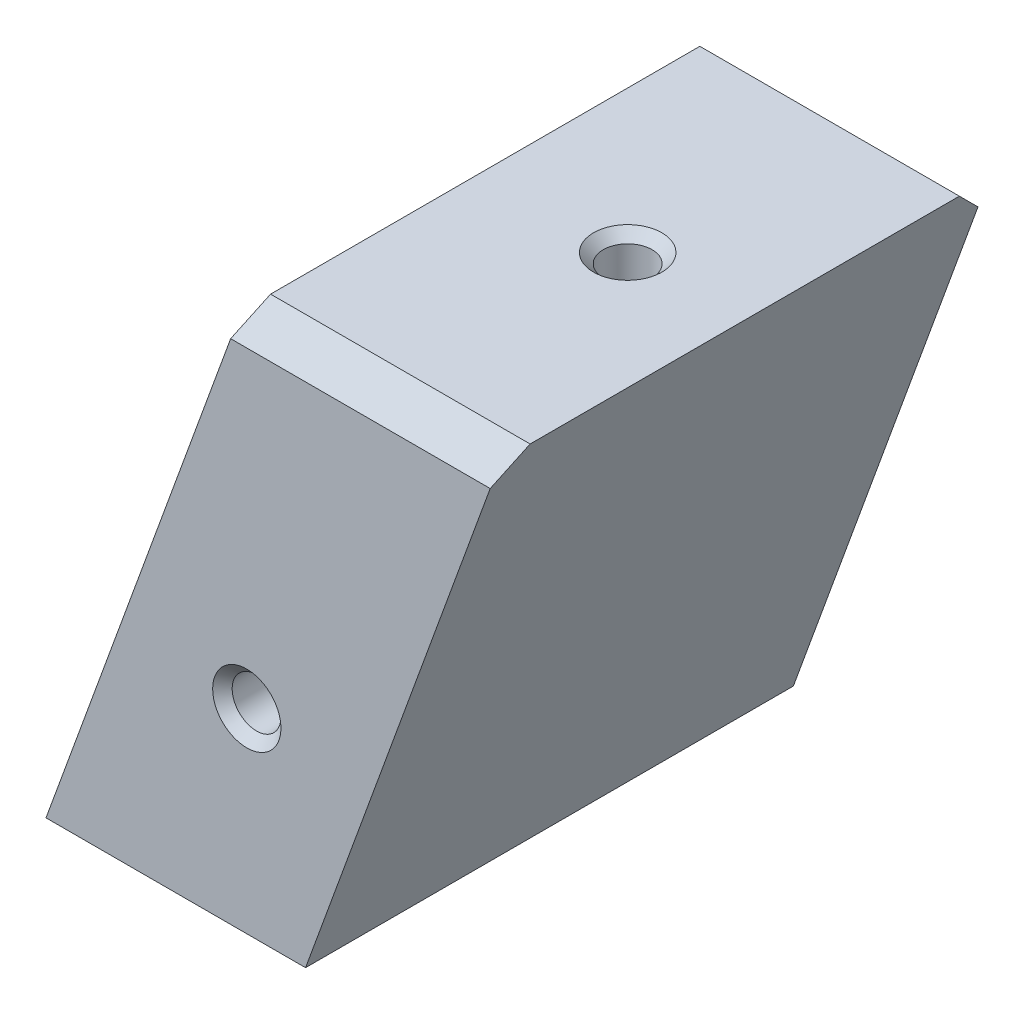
ISO-10303-21;
HEADER;
FILE_DESCRIPTION(('STEP AP214'),'2;1');
FILE_NAME('part.step','',(''),(''),'','','');
FILE_SCHEMA(('AUTOMOTIVE_DESIGN { 1 0 10303 214 1 1 1 1 }'));
ENDSEC;
DATA;
#1=APPLICATION_CONTEXT('core data for automotive mechanical design processes');
#2=APPLICATION_PROTOCOL_DEFINITION('international standard','automotive_design',2000,#1);
#3=PRODUCT_CONTEXT('',#1,'mechanical');
#4=PRODUCT('Part','Part','',(#3));
#5=PRODUCT_RELATED_PRODUCT_CATEGORY('part','',(#4));
#6=PRODUCT_DEFINITION_FORMATION('','',#4);
#7=PRODUCT_DEFINITION_CONTEXT('part definition',#1,'design');
#8=PRODUCT_DEFINITION('design','',#6,#7);
#9=PRODUCT_DEFINITION_SHAPE('','',#8);
#10=(LENGTH_UNIT() NAMED_UNIT(*) SI_UNIT(.MILLI.,.METRE.));
#11=(NAMED_UNIT(*) PLANE_ANGLE_UNIT() SI_UNIT($,.RADIAN.));
#12=(NAMED_UNIT(*) SI_UNIT($,.STERADIAN.) SOLID_ANGLE_UNIT());
#13=UNCERTAINTY_MEASURE_WITH_UNIT(LENGTH_MEASURE(1.E-05),#10,'distance_accuracy_value','');
#14=(GEOMETRIC_REPRESENTATION_CONTEXT(3) GLOBAL_UNCERTAINTY_ASSIGNED_CONTEXT((#13)) GLOBAL_UNIT_ASSIGNED_CONTEXT((#10,
#11,#12)) REPRESENTATION_CONTEXT('',''));
#15=CARTESIAN_POINT('',(0.,0.,0.));
#16=DIRECTION('',(0.,0.,1.));
#17=DIRECTION('',(1.,0.,0.));
#18=AXIS2_PLACEMENT_3D('',#15,#16,#17);
#19=CARTESIAN_POINT('',(0.,0.,25.));
#20=DIRECTION('',(0.939692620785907,-0.342020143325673,0.));
#21=DIRECTION('',(0.342020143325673,0.939692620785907,0.));
#22=AXIS2_PLACEMENT_3D('',#19,#20,#21);
#23=PLANE('',#22);
#24=CARTESIAN_POINT('',(10.9191070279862,30.,2.));
#25=DIRECTION('',(0.939692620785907,-0.342020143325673,0.));
#26=DIRECTION('',(-0.342020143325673,-0.939692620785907,0.));
#27=AXIS2_PLACEMENT_3D('',#24,#25,#26);
#28=ELLIPSE('',#27,9.57759995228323,9.);
#29=CARTESIAN_POINT('',(7.64337491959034,21.,2.));
#30=VERTEX_POINT('',#29);
#31=EDGE_CURVE('E143',#30,#30,#28,.T.);
#32=ORIENTED_EDGE('',*,*,#31,.T.);
#33=EDGE_LOOP('',(#32));
#34=FACE_BOUND('',#33,.T.);
#35=DIRECTION('',(0.,0.,-1.));
#36=VECTOR('',#35,1.);
#37=CARTESIAN_POINT('',(20.0183628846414,55.,25.));
#38=LINE('',#37,#36);
#39=CARTESIAN_POINT('',(20.0183628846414,55.,22.));
#40=VERTEX_POINT('',#39);
#41=CARTESIAN_POINT('',(20.0183628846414,55.,-22.));
#42=VERTEX_POINT('',#41);
#43=EDGE_CURVE('E163',#40,#42,#38,.T.);
#44=ORIENTED_EDGE('',*,*,#43,.T.);
#45=DIRECTION('',(-0.249243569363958,-0.684791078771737,-0.684791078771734));
#46=VECTOR('',#45,1.);
#47=CARTESIAN_POINT('',(20.0183628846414,55.,-22.));
#48=LINE('',#47,#46);
#49=CARTESIAN_POINT('',(18.9264521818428,52.,-25.));
#50=VERTEX_POINT('',#49);
#51=EDGE_CURVE('E215',#42,#50,#48,.T.);
#52=ORIENTED_EDGE('',*,*,#51,.T.);
#53=DIRECTION('',(-0.342020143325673,-0.939692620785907,0.));
#54=VECTOR('',#53,1.);
#55=CARTESIAN_POINT('',(0.,0.,-25.));
#56=LINE('',#55,#54);
#57=CARTESIAN_POINT('',(0.,0.,-25.));
#58=VERTEX_POINT('',#57);
#59=EDGE_CURVE('E152',#50,#58,#56,.T.);
#60=ORIENTED_EDGE('',*,*,#59,.T.);
#61=DIRECTION('',(0.,0.,-1.));
#62=VECTOR('',#61,1.);
#63=CARTESIAN_POINT('',(0.,0.,25.));
#64=LINE('',#63,#62);
#65=CARTESIAN_POINT('',(0.,0.,25.));
#66=VERTEX_POINT('',#65);
#67=EDGE_CURVE('E182',#66,#58,#64,.T.);
#68=ORIENTED_EDGE('',*,*,#67,.F.);
#69=DIRECTION('',(-0.342020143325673,-0.939692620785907,0.));
#70=VECTOR('',#69,1.);
#71=CARTESIAN_POINT('',(0.,0.,25.));
#72=LINE('',#71,#70);
#73=CARTESIAN_POINT('',(18.9264521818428,52.,25.));
#74=VERTEX_POINT('',#73);
#75=EDGE_CURVE('E153',#74,#66,#72,.T.);
#76=ORIENTED_EDGE('',*,*,#75,.F.);
#77=DIRECTION('',(-0.249243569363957,-0.684791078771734,0.684791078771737));
#78=VECTOR('',#77,1.);
#79=CARTESIAN_POINT('',(18.9942842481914,52.1863670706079,24.8136329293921));
#80=LINE('',#79,#78);
#81=EDGE_CURVE('E212',#74,#40,#80,.F.);
#82=ORIENTED_EDGE('',*,*,#81,.T.);
#83=EDGE_LOOP('',(#44,#52,#60,#68,#76,#82));
#84=FACE_BOUND('',#83,.T.);
#85=ADVANCED_FACE('F45',(#34,#84),#23,.F.);
#86=CARTESIAN_POINT('',(0.,0.,25.));
#87=DIRECTION('',(0.,1.,0.));
#88=DIRECTION('',(0.,0.,1.));
#89=AXIS2_PLACEMENT_3D('',#86,#87,#88);
#90=PLANE('',#89);
#91=CARTESIAN_POINT('',(15.,0.,-13.6));
#92=DIRECTION('',(0.,1.,0.));
#93=DIRECTION('',(0.,0.,1.));
#94=AXIS2_PLACEMENT_3D('',#91,#92,#93);
#95=CIRCLE('',#94,5.25000000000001);
#96=CARTESIAN_POINT('',(15.,0.,-8.34999999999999));
#97=VERTEX_POINT('',#96);
#98=EDGE_CURVE('E194',#97,#97,#95,.T.);
#99=ORIENTED_EDGE('',*,*,#98,.T.);
#100=EDGE_LOOP('',(#99));
#101=FACE_BOUND('',#100,.T.);
#102=CARTESIAN_POINT('',(15.,0.,16.4));
#103=DIRECTION('',(0.,1.,0.));
#104=DIRECTION('',(0.,0.,1.));
#105=AXIS2_PLACEMENT_3D('',#102,#103,#104);
#106=CIRCLE('',#105,5.25000000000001);
#107=CARTESIAN_POINT('',(15.,0.,21.65));
#108=VERTEX_POINT('',#107);
#109=EDGE_CURVE('E190',#108,#108,#106,.T.);
#110=ORIENTED_EDGE('',*,*,#109,.T.);
#111=EDGE_LOOP('',(#110));
#112=FACE_BOUND('',#111,.T.);
#113=DIRECTION('',(1.,0.,0.));
#114=VECTOR('',#113,1.);
#115=CARTESIAN_POINT('',(0.,0.,-25.));
#116=LINE('',#115,#114);
#117=CARTESIAN_POINT('',(26.6044443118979,0.,-25.));
#118=VERTEX_POINT('',#117);
#119=EDGE_CURVE('E166',#58,#118,#116,.T.);
#120=ORIENTED_EDGE('',*,*,#119,.T.);
#121=DIRECTION('',(0.,0.,-1.));
#122=VECTOR('',#121,1.);
#123=CARTESIAN_POINT('',(26.6044443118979,0.,25.));
#124=LINE('',#123,#122);
#125=CARTESIAN_POINT('',(26.6044443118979,0.,25.));
#126=VERTEX_POINT('',#125);
#127=EDGE_CURVE('E178',#126,#118,#124,.T.);
#128=ORIENTED_EDGE('',*,*,#127,.F.);
#129=DIRECTION('',(1.,0.,0.));
#130=VECTOR('',#129,1.);
#131=CARTESIAN_POINT('',(0.,0.,25.));
#132=LINE('',#131,#130);
#133=EDGE_CURVE('E156',#66,#126,#132,.T.);
#134=ORIENTED_EDGE('',*,*,#133,.F.);
#135=ORIENTED_EDGE('',*,*,#67,.T.);
#136=EDGE_LOOP('',(#120,#128,#134,#135));
#137=FACE_BOUND('',#136,.T.);
#138=ADVANCED_FACE('F296',(#101,#112,#137),#90,.F.);
#139=CARTESIAN_POINT('',(46.6228071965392,55.,25.));
#140=DIRECTION('',(-0.939692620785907,0.342020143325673,0.));
#141=DIRECTION('',(-0.342020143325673,-0.939692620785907,0.));
#142=AXIS2_PLACEMENT_3D('',#139,#140,#141);
#143=PLANE('',#142);
#144=DIRECTION('',(0.342020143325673,0.939692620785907,0.));
#145=VECTOR('',#144,1.);
#146=CARTESIAN_POINT('',(46.6228071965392,55.,-25.));
#147=LINE('',#146,#145);
#148=CARTESIAN_POINT('',(45.5308964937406,52.,-25.));
#149=VERTEX_POINT('',#148);
#150=EDGE_CURVE('E157',#118,#149,#147,.T.);
#151=ORIENTED_EDGE('',*,*,#150,.T.);
#152=DIRECTION('',(0.249243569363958,0.684791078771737,0.684791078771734));
#153=VECTOR('',#152,1.);
#154=CARTESIAN_POINT('',(44.9700764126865,50.459159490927,-26.5408405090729));
#155=LINE('',#154,#153);
#156=CARTESIAN_POINT('',(46.6228071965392,55.,-22.));
#157=VERTEX_POINT('',#156);
#158=EDGE_CURVE('E222',#149,#157,#155,.T.);
#159=ORIENTED_EDGE('',*,*,#158,.T.);
#160=DIRECTION('',(0.,0.,-1.));
#161=VECTOR('',#160,1.);
#162=CARTESIAN_POINT('',(46.6228071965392,55.,25.));
#163=LINE('',#162,#161);
#164=CARTESIAN_POINT('',(46.6228071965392,55.,22.));
#165=VERTEX_POINT('',#164);
#166=EDGE_CURVE('E174',#165,#157,#163,.T.);
#167=ORIENTED_EDGE('',*,*,#166,.F.);
#168=DIRECTION('',(0.249243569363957,0.684791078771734,-0.684791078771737));
#169=VECTOR('',#168,1.);
#170=CARTESIAN_POINT('',(43.9459977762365,47.645526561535,29.3544734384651));
#171=LINE('',#170,#169);
#172=CARTESIAN_POINT('',(45.5308964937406,52.,25.));
#173=VERTEX_POINT('',#172);
#174=EDGE_CURVE('E61',#165,#173,#171,.F.);
#175=ORIENTED_EDGE('',*,*,#174,.T.);
#176=DIRECTION('',(0.342020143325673,0.939692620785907,0.));
#177=VECTOR('',#176,1.);
#178=CARTESIAN_POINT('',(46.6228071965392,55.,25.));
#179=LINE('',#178,#177);
#180=EDGE_CURVE('E160',#126,#173,#179,.T.);
#181=ORIENTED_EDGE('',*,*,#180,.F.);
#182=ORIENTED_EDGE('',*,*,#127,.T.);
#183=EDGE_LOOP('',(#151,#159,#167,#175,#181,#182));
#184=FACE_BOUND('',#183,.T.);
#185=ADVANCED_FACE('F302',(#184),#143,.F.);
#186=CARTESIAN_POINT('',(20.0183628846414,55.,25.));
#187=DIRECTION('',(0.,-1.,0.));
#188=DIRECTION('',(0.,0.,-1.));
#189=AXIS2_PLACEMENT_3D('',#186,#187,#188);
#190=PLANE('',#189);
#191=CARTESIAN_POINT('',(34.6228071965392,55.,0.));
#192=DIRECTION('',(0.,-1.,0.));
#193=DIRECTION('',(0.,0.,-1.));
#194=AXIS2_PLACEMENT_3D('',#191,#192,#193);
#195=CIRCLE('',#194,3.49999999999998);
#196=CARTESIAN_POINT('',(34.6228071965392,55.,-3.49999999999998));
#197=VERTEX_POINT('',#196);
#198=EDGE_CURVE('E11',#197,#197,#195,.T.);
#199=ORIENTED_EDGE('',*,*,#198,.T.);
#200=EDGE_LOOP('',(#199));
#201=FACE_BOUND('',#200,.T.);
#202=ORIENTED_EDGE('',*,*,#166,.T.);
#203=DIRECTION('',(-1.,0.,0.));
#204=VECTOR('',#203,1.);
#205=CARTESIAN_POINT('',(20.0183628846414,55.,-22.));
#206=LINE('',#205,#204);
#207=EDGE_CURVE('E208',#157,#42,#206,.T.);
#208=ORIENTED_EDGE('',*,*,#207,.T.);
#209=ORIENTED_EDGE('',*,*,#43,.F.);
#210=DIRECTION('',(1.,0.,0.));
#211=VECTOR('',#210,1.);
#212=CARTESIAN_POINT('',(20.0183628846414,55.,22.));
#213=LINE('',#212,#211);
#214=EDGE_CURVE('E202',#40,#165,#213,.T.);
#215=ORIENTED_EDGE('',*,*,#214,.T.);
#216=EDGE_LOOP('',(#202,#208,#209,#215));
#217=FACE_BOUND('',#216,.T.);
#218=ADVANCED_FACE('F366',(#201,#217),#190,.F.);
#219=CARTESIAN_POINT('',(20.0183628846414,55.,25.));
#220=DIRECTION('',(0.,0.,-1.));
#221=DIRECTION('',(-1.,0.,0.));
#222=AXIS2_PLACEMENT_3D('',#219,#220,#221);
#223=PLANE('',#222);
#224=CARTESIAN_POINT('',(20.5816268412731,20.,25.));
#225=DIRECTION('',(0.,0.,-1.));
#226=DIRECTION('',(-1.,0.,0.));
#227=AXIS2_PLACEMENT_3D('',#224,#225,#226);
#228=CIRCLE('',#227,3.5);
#229=CARTESIAN_POINT('',(17.0816268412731,20.,25.));
#230=VERTEX_POINT('',#229);
#231=EDGE_CURVE('E331',#230,#230,#228,.T.);
#232=ORIENTED_EDGE('',*,*,#231,.T.);
#233=EDGE_LOOP('',(#232));
#234=FACE_BOUND('',#233,.T.);
#235=ORIENTED_EDGE('',*,*,#180,.T.);
#236=DIRECTION('',(-1.,0.,0.));
#237=VECTOR('',#236,1.);
#238=CARTESIAN_POINT('',(20.0183628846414,52.,25.));
#239=LINE('',#238,#237);
#240=EDGE_CURVE('E225',#173,#74,#239,.T.);
#241=ORIENTED_EDGE('',*,*,#240,.T.);
#242=ORIENTED_EDGE('',*,*,#75,.T.);
#243=ORIENTED_EDGE('',*,*,#133,.T.);
#244=EDGE_LOOP('',(#235,#241,#242,#243));
#245=FACE_BOUND('',#244,.T.);
#246=ADVANCED_FACE('F362',(#234,#245),#223,.F.);
#247=CARTESIAN_POINT('',(20.0183628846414,55.,-25.));
#248=DIRECTION('',(0.,0.,-1.));
#249=DIRECTION('',(-1.,0.,0.));
#250=AXIS2_PLACEMENT_3D('',#247,#248,#249);
#251=PLANE('',#250);
#252=CARTESIAN_POINT('',(20.5816268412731,20.,-25.));
#253=DIRECTION('',(0.,0.,-1.));
#254=DIRECTION('',(-1.,0.,0.));
#255=AXIS2_PLACEMENT_3D('',#252,#253,#254);
#256=CIRCLE('',#255,3.5);
#257=CARTESIAN_POINT('',(17.0816268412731,20.,-25.));
#258=VERTEX_POINT('',#257);
#259=EDGE_CURVE('E280',#258,#258,#256,.F.);
#260=ORIENTED_EDGE('',*,*,#259,.T.);
#261=EDGE_LOOP('',(#260));
#262=FACE_BOUND('',#261,.T.);
#263=ORIENTED_EDGE('',*,*,#59,.F.);
#264=DIRECTION('',(1.,0.,0.));
#265=VECTOR('',#264,1.);
#266=CARTESIAN_POINT('',(46.6228071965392,52.,-25.));
#267=LINE('',#266,#265);
#268=EDGE_CURVE('E69',#50,#149,#267,.T.);
#269=ORIENTED_EDGE('',*,*,#268,.T.);
#270=ORIENTED_EDGE('',*,*,#150,.F.);
#271=ORIENTED_EDGE('',*,*,#119,.F.);
#272=EDGE_LOOP('',(#263,#269,#270,#271));
#273=FACE_BOUND('',#272,.T.);
#274=ADVANCED_FACE('F357',(#262,#273),#251,.T.);
#275=CARTESIAN_POINT('',(15.,24.5,-13.6));
#276=DIRECTION('',(0.,-1.,0.));
#277=DIRECTION('',(0.,0.,-1.));
#278=AXIS2_PLACEMENT_3D('',#275,#276,#277);
#279=CONICAL_SURFACE('',#278,4.24999999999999,1.02974425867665);
#280=CARTESIAN_POINT('',(15.,27.0536576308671,-13.6));
#281=VERTEX_POINT('',#280);
#282=VERTEX_LOOP('',#281);
#283=FACE_BOUND('',#282,.T.);
#284=CARTESIAN_POINT('',(15.,24.5,-13.6));
#285=DIRECTION('',(0.,-1.,0.));
#286=DIRECTION('',(0.,0.,-1.));
#287=AXIS2_PLACEMENT_3D('',#284,#285,#286);
#288=CIRCLE('',#287,4.24999999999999);
#289=CARTESIAN_POINT('',(15.,24.5,-17.85));
#290=VERTEX_POINT('',#289);
#291=EDGE_CURVE('E148',#290,#290,#288,.T.);
#292=ORIENTED_EDGE('',*,*,#291,.T.);
#293=EDGE_LOOP('',(#292));
#294=FACE_BOUND('',#293,.T.);
#295=ADVANCED_FACE('F351',(#283,#294),#279,.F.);
#296=CARTESIAN_POINT('',(15.,0.,-13.6));
#297=DIRECTION('',(0.,-1.,0.));
#298=DIRECTION('',(0.,0.,-1.));
#299=AXIS2_PLACEMENT_3D('',#296,#297,#298);
#300=CYLINDRICAL_SURFACE('',#299,4.24999999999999);
#301=CARTESIAN_POINT('',(18.0816268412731,20.,-10.6732140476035));
#302=CARTESIAN_POINT('',(18.0816284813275,19.8991023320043,-10.6732141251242));
#303=CARTESIAN_POINT('',(18.0877774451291,19.7981884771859,-10.6796490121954));
#304=CARTESIAN_POINT('',(18.1118924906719,19.5994525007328,-10.7053623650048));
#305=CARTESIAN_POINT('',(18.1298611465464,19.5016310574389,-10.7246436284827));
#306=CARTESIAN_POINT('',(18.1761461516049,19.3121322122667,-10.7758588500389));
#307=CARTESIAN_POINT('',(18.2044455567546,19.2204450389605,-10.807772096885));
#308=CARTESIAN_POINT('',(18.2691576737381,19.0454330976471,-10.8838287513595));
#309=CARTESIAN_POINT('',(18.3055701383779,18.9621080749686,-10.9279717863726));
#310=CARTESIAN_POINT('',(18.384157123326,18.8046068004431,-11.0282176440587));
#311=CARTESIAN_POINT('',(18.4263895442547,18.7305388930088,-11.084444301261));
#312=CARTESIAN_POINT('',(18.5132996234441,18.593362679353,-11.2073264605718));
#313=CARTESIAN_POINT('',(18.5579778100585,18.5302567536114,-11.273984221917));
#314=CARTESIAN_POINT('',(18.6524410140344,18.4078520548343,-11.4249090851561));
#315=CARTESIAN_POINT('',(18.7021845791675,18.3499553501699,-11.5103322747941));
#316=CARTESIAN_POINT('',(18.798140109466,18.246671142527,-11.6902765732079));
#317=CARTESIAN_POINT('',(18.8443486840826,18.201295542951,-11.784806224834));
#318=CARTESIAN_POINT('',(18.9202917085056,18.1313292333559,-11.9567205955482));
#319=CARTESIAN_POINT('',(18.9512847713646,18.1043708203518,-12.0326133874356));
#320=CARTESIAN_POINT('',(19.0093115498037,18.0559695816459,-12.1876372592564));
#321=CARTESIAN_POINT('',(19.0363436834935,18.0345289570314,-12.2667696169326));
#322=CARTESIAN_POINT('',(19.0859731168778,17.9965035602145,-12.4276426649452));
#323=CARTESIAN_POINT('',(19.1085652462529,17.9799244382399,-12.5093862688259));
#324=CARTESIAN_POINT('',(19.1489469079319,17.9510872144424,-12.6748029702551));
#325=CARTESIAN_POINT('',(19.1667358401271,17.9388296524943,-12.7584763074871));
#326=CARTESIAN_POINT('',(19.1975160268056,17.9180327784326,-12.9284829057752));
#327=CARTESIAN_POINT('',(19.2104304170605,17.909552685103,-13.0148372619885));
#328=CARTESIAN_POINT('',(19.2309302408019,17.896249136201,-13.1884530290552));
#329=CARTESIAN_POINT('',(19.2385155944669,17.8914257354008,-13.2757144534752));
#330=CARTESIAN_POINT('',(19.248280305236,17.8852374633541,-13.4506872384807));
#331=CARTESIAN_POINT('',(19.2504580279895,17.8838736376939,-13.5383987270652));
#332=CARTESIAN_POINT('',(19.2493818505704,17.8845513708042,-13.7137744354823));
#333=CARTESIAN_POINT('',(19.2461278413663,17.8865929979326,-13.8014386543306));
#334=CARTESIAN_POINT('',(19.2333688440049,17.894704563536,-13.9887233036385));
#335=CARTESIAN_POINT('',(19.2230387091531,17.9013073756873,-14.0882662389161));
#336=CARTESIAN_POINT('',(19.1954638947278,17.9194173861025,-14.2859628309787));
#337=CARTESIAN_POINT('',(19.178217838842,17.9309255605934,-14.3841162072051));
#338=CARTESIAN_POINT('',(19.1370939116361,17.9594239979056,-14.5781523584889));
#339=CARTESIAN_POINT('',(19.1132204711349,17.9764105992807,-14.6740366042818));
#340=CARTESIAN_POINT('',(19.0592797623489,18.0166711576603,-14.8626790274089));
#341=CARTESIAN_POINT('',(19.0292151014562,18.0399424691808,-14.955438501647));
#342=CARTESIAN_POINT('',(18.9729972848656,18.0860454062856,-15.110805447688));
#343=CARTESIAN_POINT('',(18.9481921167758,18.1070920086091,-15.1744360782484));
#344=CARTESIAN_POINT('',(18.8961434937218,18.1532846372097,-15.2991550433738));
#345=CARTESIAN_POINT('',(18.8689006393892,18.1784296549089,-15.3602439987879));
#346=CARTESIAN_POINT('',(18.8124695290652,18.2331880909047,-15.4793373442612));
#347=CARTESIAN_POINT('',(18.783284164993,18.2627949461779,-15.5373460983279));
#348=CARTESIAN_POINT('',(18.7235329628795,18.3268573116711,-15.6498454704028));
#349=CARTESIAN_POINT('',(18.6929673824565,18.3613119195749,-15.704336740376));
#350=CARTESIAN_POINT('',(18.611907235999,18.4584669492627,-15.8419494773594));
#351=CARTESIAN_POINT('',(18.5608311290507,18.5254152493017,-15.9218210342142));
#352=CARTESIAN_POINT('',(18.4606718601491,18.6735311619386,-16.0686377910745));
#353=CARTESIAN_POINT('',(18.4115881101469,18.754694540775,-16.135586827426));
#354=CARTESIAN_POINT('',(18.3194681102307,18.9310829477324,-16.2550665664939));
#355=CARTESIAN_POINT('',(18.2764739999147,19.0263974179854,-16.3074989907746));
#356=CARTESIAN_POINT('',(18.2012915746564,19.228265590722,-16.396004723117));
#357=CARTESIAN_POINT('',(18.169098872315,19.3348147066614,-16.4320846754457));
#358=CARTESIAN_POINT('',(18.1218342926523,19.5423927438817,-16.4840485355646));
#359=CARTESIAN_POINT('',(18.1051962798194,19.6426014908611,-16.5018059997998));
#360=CARTESIAN_POINT('',(18.0843054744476,19.8457426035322,-16.5240045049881));
#361=CARTESIAN_POINT('',(18.0800485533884,19.9486740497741,-16.5284499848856));
#362=CARTESIAN_POINT('',(18.0841490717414,20.1486185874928,-16.5241279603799));
#363=CARTESIAN_POINT('',(18.0918618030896,20.2456609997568,-16.5160357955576));
#364=CARTESIAN_POINT('',(18.1181406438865,20.4364696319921,-16.4879171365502));
#365=CARTESIAN_POINT('',(18.1367046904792,20.5302364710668,-16.4678929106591));
#366=CARTESIAN_POINT('',(18.1833393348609,20.7120679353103,-16.4160356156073));
#367=CARTESIAN_POINT('',(18.2114213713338,20.8001255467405,-16.384188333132));
#368=CARTESIAN_POINT('',(18.2750139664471,20.968311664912,-16.3090945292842));
#369=CARTESIAN_POINT('',(18.3105252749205,21.0484393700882,-16.265846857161));
#370=CARTESIAN_POINT('',(18.3882635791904,21.2029092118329,-16.1663835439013));
#371=CARTESIAN_POINT('',(18.4307296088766,21.2767950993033,-16.1096490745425));
#372=CARTESIAN_POINT('',(18.5180186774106,21.4135476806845,-15.985746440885));
#373=CARTESIAN_POINT('',(18.5628424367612,21.4764109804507,-15.9185750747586));
#374=CARTESIAN_POINT('',(18.6575244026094,21.5982799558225,-15.7665565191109));
#375=CARTESIAN_POINT('',(18.7073286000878,21.6558759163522,-15.6805524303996));
#376=CARTESIAN_POINT('',(18.8032883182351,21.7585412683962,-15.4994769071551));
#377=CARTESIAN_POINT('',(18.8494404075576,21.803598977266,-15.4043971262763));
#378=CARTESIAN_POINT('',(18.9252187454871,21.8730350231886,-15.231495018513));
#379=CARTESIAN_POINT('',(18.9561231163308,21.8997751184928,-15.1551538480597));
#380=CARTESIAN_POINT('',(19.0139140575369,21.9477394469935,-14.9992509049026));
#381=CARTESIAN_POINT('',(19.0407990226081,21.9689614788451,-14.9196878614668));
#382=CARTESIAN_POINT('',(19.0900802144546,22.0065517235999,-14.7579729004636));
#383=CARTESIAN_POINT('',(19.1124712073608,22.0229142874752,-14.6758180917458));
#384=CARTESIAN_POINT('',(19.152400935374,22.0513199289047,-14.5096008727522));
#385=CARTESIAN_POINT('',(19.1699390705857,22.0633624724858,-14.4255382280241));
#386=CARTESIAN_POINT('',(19.2001645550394,22.0837223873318,-14.2547884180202));
#387=CARTESIAN_POINT('',(19.2127753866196,22.0919813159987,-14.1680808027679));
#388=CARTESIAN_POINT('',(19.2326264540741,22.1048366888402,-13.993786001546));
#389=CARTESIAN_POINT('',(19.2398666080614,22.1094330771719,-13.9061988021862));
#390=CARTESIAN_POINT('',(19.2489026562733,22.1151536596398,-13.7306036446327));
#391=CARTESIAN_POINT('',(19.2506968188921,22.1162767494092,-13.6425955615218));
#392=CARTESIAN_POINT('',(19.2488187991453,22.1150941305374,-13.4666616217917));
#393=CARTESIAN_POINT('',(19.245146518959,22.1127883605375,-13.3787357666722));
#394=CARTESIAN_POINT('',(19.2314770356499,22.1040849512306,-13.191182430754));
#395=CARTESIAN_POINT('',(19.2206676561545,22.0971605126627,-13.0916368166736));
#396=CARTESIAN_POINT('',(19.1921376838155,22.0783674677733,-12.8939883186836));
#397=CARTESIAN_POINT('',(19.1744157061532,22.0664978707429,-12.7958857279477));
#398=CARTESIAN_POINT('',(19.132355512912,22.0372209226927,-12.6020177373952));
#399=CARTESIAN_POINT('',(19.1080220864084,22.0198175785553,-12.5062507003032));
#400=CARTESIAN_POINT('',(19.0531915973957,21.9786516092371,-12.317914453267));
#401=CARTESIAN_POINT('',(19.0226971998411,21.9548917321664,-12.2253438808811));
#402=CARTESIAN_POINT('',(18.965942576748,21.9080072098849,-12.0707939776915));
#403=CARTESIAN_POINT('',(18.9410354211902,21.8867125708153,-12.0077565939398));
#404=CARTESIAN_POINT('',(18.8888486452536,21.840034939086,-11.8842356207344));
#405=CARTESIAN_POINT('',(18.8615696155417,21.8146529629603,-11.8237514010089));
#406=CARTESIAN_POINT('',(18.8051344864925,21.7594400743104,-11.7058741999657));
#407=CARTESIAN_POINT('',(18.7759811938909,21.7296157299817,-11.648476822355));
#408=CARTESIAN_POINT('',(18.7163625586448,21.6651479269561,-11.5372006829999));
#409=CARTESIAN_POINT('',(18.6858974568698,21.6305053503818,-11.4833212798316));
#410=CARTESIAN_POINT('',(18.6050696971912,21.5327690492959,-11.3471037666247));
#411=CARTESIAN_POINT('',(18.5541759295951,21.4654292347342,-11.2680350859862));
#412=CARTESIAN_POINT('',(18.4545414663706,21.3166254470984,-11.1228194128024));
#413=CARTESIAN_POINT('',(18.4058003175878,21.2351644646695,-11.056669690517));
#414=CARTESIAN_POINT('',(18.3144964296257,21.0583337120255,-10.9387542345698));
#415=CARTESIAN_POINT('',(18.2719770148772,20.9628748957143,-10.8870872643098));
#416=CARTESIAN_POINT('',(18.1978248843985,20.7609320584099,-10.8000492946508));
#417=CARTESIAN_POINT('',(18.1661835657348,20.6544568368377,-10.7646654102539));
#418=CARTESIAN_POINT('',(18.1220581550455,20.4567454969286,-10.7162371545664));
#419=CARTESIAN_POINT('',(18.1069847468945,20.3668227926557,-10.7001105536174));
#420=CARTESIAN_POINT('',(18.0867691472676,20.1846043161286,-10.678599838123));
#421=CARTESIAN_POINT('',(18.0816253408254,20.0923089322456,-10.6732139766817));
#422=CARTESIAN_POINT('',(18.0816268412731,20.,-10.6732140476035));
#423=B_SPLINE_CURVE_WITH_KNOTS('',3,(#301,#302,#303,#304,#305,#306,#307,#308,#309,#310,#311,
#312,#313,#314,#315,#316,#317,#318,#319,#320,#321,#322,#323,#324,#325,#326,#327,#328,#329,#330,
#331,#332,#333,#334,#335,#336,#337,#338,#339,#340,#341,#342,#343,#344,#345,#346,#347,#348,#349,
#350,#351,#352,#353,#354,#355,#356,#357,#358,#359,#360,#361,#362,#363,#364,#365,#366,#367,#368,
#369,#370,#371,#372,#373,#374,#375,#376,#377,#378,#379,#380,#381,#382,#383,#384,#385,#386,#387,
#388,#389,#390,#391,#392,#393,#394,#395,#396,#397,#398,#399,#400,#401,#402,#403,#404,#405,#406,
#407,#408,#409,#410,#411,#412,#413,#414,#415,#416,#417,#418,#419,#420,#421,#422),.UNSPECIFIED.,
.T.,.F.,(4,2,2,2,2,2,2,2,2,2,2,2,2,2,2,2,2,2,2,2,2,2,2,2,2,2,2,2,2,2,2,2,2,2,2,2,2,2,2,2,2,2,2,
2,2,2,2,2,2,2,2,2,2,2,2,2,2,2,2,2,4),(0.,0.302334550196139,0.604734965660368,0.906641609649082,
1.20853905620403,1.5136919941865,1.81891111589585,2.16134037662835,2.50409406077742,
2.76265861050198,3.02132614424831,3.28029313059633,3.53929245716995,3.80222030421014,
4.06515208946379,4.32816333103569,4.59117985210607,4.89169890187,5.19227778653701,
5.49265619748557,5.79290836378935,6.00711892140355,6.22127684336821,6.43512277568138,
6.64892895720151,6.99559193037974,7.34215182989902,7.69100357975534,8.03971345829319,
8.34749008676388,8.65516407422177,8.94683213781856,9.23844477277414,9.53040911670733,
9.82240294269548,10.1282805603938,10.4342522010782,10.7776069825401,11.1212806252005,
11.3807299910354,11.6402827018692,11.9001359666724,12.1600213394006,12.4237957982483,
12.6875742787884,12.9514366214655,13.2153036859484,13.5160455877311,13.8168477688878,
14.1174326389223,14.4178877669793,14.6308456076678,14.8437505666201,15.056343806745,
15.268898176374,15.6143508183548,15.9597303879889,16.3074109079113,16.6548158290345,
16.9314596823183,17.2080585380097),.UNSPECIFIED.);
#424=CARTESIAN_POINT('',(18.0816268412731,20.,-10.6732140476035));
#425=VERTEX_POINT('',#424);
#426=EDGE_CURVE('E138',#425,#425,#423,.T.);
#427=ORIENTED_EDGE('',*,*,#426,.T.);
#428=EDGE_LOOP('',(#427));
#429=FACE_BOUND('',#428,.T.);
#430=CARTESIAN_POINT('',(15.,1.00000000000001,-13.6));
#431=DIRECTION('',(0.,1.,0.));
#432=DIRECTION('',(0.,0.,1.));
#433=AXIS2_PLACEMENT_3D('',#430,#431,#432);
#434=CIRCLE('',#433,4.24999999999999);
#435=CARTESIAN_POINT('',(15.,1.00000000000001,-9.35000000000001));
#436=VERTEX_POINT('',#435);
#437=EDGE_CURVE('E186',#436,#436,#434,.F.);
#438=ORIENTED_EDGE('',*,*,#437,.T.);
#439=EDGE_LOOP('',(#438));
#440=FACE_BOUND('',#439,.T.);
#441=ORIENTED_EDGE('',*,*,#291,.F.);
#442=EDGE_LOOP('',(#441));
#443=FACE_BOUND('',#442,.T.);
#444=ADVANCED_FACE('F239',(#429,#440,#443),#300,.F.);
#445=CARTESIAN_POINT('',(15.,24.5,16.4));
#446=DIRECTION('',(0.,-1.,0.));
#447=DIRECTION('',(0.,0.,-1.));
#448=AXIS2_PLACEMENT_3D('',#445,#446,#447);
#449=CONICAL_SURFACE('',#448,4.24999999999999,1.02974425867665);
#450=CARTESIAN_POINT('',(15.,27.0536576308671,16.4));
#451=VERTEX_POINT('',#450);
#452=VERTEX_LOOP('',#451);
#453=FACE_BOUND('',#452,.T.);
#454=CARTESIAN_POINT('',(15.,24.5,16.4));
#455=DIRECTION('',(0.,-1.,0.));
#456=DIRECTION('',(0.,0.,-1.));
#457=AXIS2_PLACEMENT_3D('',#454,#455,#456);
#458=CIRCLE('',#457,4.24999999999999);
#459=CARTESIAN_POINT('',(15.,24.5,12.15));
#460=VERTEX_POINT('',#459);
#461=EDGE_CURVE('E144',#460,#460,#458,.T.);
#462=ORIENTED_EDGE('',*,*,#461,.T.);
#463=EDGE_LOOP('',(#462));
#464=FACE_BOUND('',#463,.T.);
#465=ADVANCED_FACE('F271',(#453,#464),#449,.F.);
#466=CARTESIAN_POINT('',(15.,0.,16.4));
#467=DIRECTION('',(0.,-1.,0.));
#468=DIRECTION('',(0.,0.,-1.));
#469=AXIS2_PLACEMENT_3D('',#466,#467,#468);
#470=CYLINDRICAL_SURFACE('',#469,4.24999999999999);
#471=CARTESIAN_POINT('',(19.25,22.115837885,16.4));
#472=CARTESIAN_POINT('',(19.2500014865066,22.1158345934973,16.5064817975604));
#473=CARTESIAN_POINT('',(19.2459947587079,22.1133318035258,16.6129441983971));
#474=CARTESIAN_POINT('',(19.2300260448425,22.1031571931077,16.8250772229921));
#475=CARTESIAN_POINT('',(19.2180611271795,22.0954834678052,16.9307475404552));
#476=CARTESIAN_POINT('',(19.186357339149,22.0745079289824,17.1403741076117));
#477=CARTESIAN_POINT('',(19.1666169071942,22.061204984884,17.24433000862));
#478=CARTESIAN_POINT('',(19.1197215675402,22.0282153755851,17.449500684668));
#479=CARTESIAN_POINT('',(19.0925701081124,22.0085316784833,17.5507167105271));
#480=CARTESIAN_POINT('',(19.0402826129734,21.9685022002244,17.7206388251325));
#481=CARTESIAN_POINT('',(19.0168251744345,21.9499858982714,17.7902992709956));
#482=CARTESIAN_POINT('',(18.9667914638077,21.9087584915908,17.9272108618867));
#483=CARTESIAN_POINT('',(18.9402159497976,21.8860484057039,17.9944625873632));
#484=CARTESIAN_POINT('',(18.8844192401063,21.8359976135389,18.1259416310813));
#485=CARTESIAN_POINT('',(18.8552028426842,21.8086652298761,18.1901741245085));
#486=CARTESIAN_POINT('',(18.7946710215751,21.7488848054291,18.3151504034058));
#487=CARTESIAN_POINT('',(18.7633560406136,21.7164378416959,18.3758949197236));
#488=CARTESIAN_POINT('',(18.6805406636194,21.6252926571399,18.5277493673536));
#489=CARTESIAN_POINT('',(18.6279597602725,21.5623495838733,18.6158070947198));
#490=CARTESIAN_POINT('',(18.5230704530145,21.4212829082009,18.7790560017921));
#491=CARTESIAN_POINT('',(18.4707619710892,21.3431639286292,18.8542510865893));
#492=CARTESIAN_POINT('',(18.3707063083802,21.1712288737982,18.98998448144));
#493=CARTESIAN_POINT('',(18.3229976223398,21.0772958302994,19.0504046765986));
#494=CARTESIAN_POINT('',(18.2376709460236,20.8762164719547,19.1540035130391));
#495=CARTESIAN_POINT('',(18.2000469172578,20.7690781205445,19.197192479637));
#496=CARTESIAN_POINT('',(18.1431563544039,20.560337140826,19.2608820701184));
#497=CARTESIAN_POINT('',(18.1221110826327,20.4599009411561,19.2836399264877));
#498=CARTESIAN_POINT('',(18.0925269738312,20.2550839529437,19.3153491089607));
#499=CARTESIAN_POINT('',(18.0839835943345,20.1507046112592,19.3243054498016));
#500=CARTESIAN_POINT('',(18.0802473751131,19.9483797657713,19.3282374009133));
#501=CARTESIAN_POINT('',(18.0842098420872,19.8504647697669,19.3240975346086));
#502=CARTESIAN_POINT('',(18.1033586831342,19.6570342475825,19.3037662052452));
#503=CARTESIAN_POINT('',(18.1185424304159,19.5615181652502,19.2875775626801));
#504=CARTESIAN_POINT('',(18.1588855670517,19.3760753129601,19.2433820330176));
#505=CARTESIAN_POINT('',(18.1839879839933,19.2861199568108,19.215442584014));
#506=CARTESIAN_POINT('',(18.2423166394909,19.1134695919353,19.1480643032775));
#507=CARTESIAN_POINT('',(18.2755433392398,19.0307749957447,19.108624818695));
#508=CARTESIAN_POINT('',(18.3491267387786,18.8713045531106,19.0171380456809));
#509=CARTESIAN_POINT('',(18.3897084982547,18.7948786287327,18.9646642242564));
#510=CARTESIAN_POINT('',(18.4741332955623,18.6526603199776,18.8490844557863));
#511=CARTESIAN_POINT('',(18.5179771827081,18.5868707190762,18.7859757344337));
#512=CARTESIAN_POINT('',(18.6108838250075,18.4595310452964,18.6432157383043));
#513=CARTESIAN_POINT('',(18.6599993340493,18.3992039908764,18.5625143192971));
#514=CARTESIAN_POINT('',(18.7556399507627,18.2909038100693,18.3917959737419));
#515=CARTESIAN_POINT('',(18.80216274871,18.2429415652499,18.3017709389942));
#516=CARTESIAN_POINT('',(18.8791530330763,18.1686956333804,18.1380157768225));
#517=CARTESIAN_POINT('',(18.9107188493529,18.1399924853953,18.0658695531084));
#518=CARTESIAN_POINT('',(18.9703756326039,18.0880808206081,17.9182079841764));
#519=CARTESIAN_POINT('',(18.9984652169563,18.0648744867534,17.842691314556));
#520=CARTESIAN_POINT('',(19.0506566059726,18.0233250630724,17.6889085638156));
#521=CARTESIAN_POINT('',(19.0747541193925,18.0049871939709,17.6106396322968));
#522=CARTESIAN_POINT('',(19.1185686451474,17.972636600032,17.4519831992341));
#523=CARTESIAN_POINT('',(19.1382839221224,17.9586255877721,17.3715948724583));
#524=CARTESIAN_POINT('',(19.1733546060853,17.9342718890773,17.2079182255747));
#525=CARTESIAN_POINT('',(19.1886330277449,17.9239932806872,17.1246039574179));
#526=CARTESIAN_POINT('',(19.2142161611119,17.9070539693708,16.9568504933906));
#527=CARTESIAN_POINT('',(19.2245205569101,17.9003934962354,16.8724112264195));
#528=CARTESIAN_POINT('',(19.2400510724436,17.890436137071,16.7028481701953));
#529=CARTESIAN_POINT('',(19.2452758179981,17.8871401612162,16.6177242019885));
#530=CARTESIAN_POINT('',(19.2505923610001,17.8837872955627,16.4472736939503));
#531=CARTESIAN_POINT('',(19.2506852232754,17.883729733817,16.3619471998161));
#532=CARTESIAN_POINT('',(19.2453282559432,17.8871059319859,16.1773739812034));
#533=CARTESIAN_POINT('',(19.2389577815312,17.8911195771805,16.0781625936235));
#534=CARTESIAN_POINT('',(19.2193214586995,17.9037510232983,15.880699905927));
#535=CARTESIAN_POINT('',(19.2060543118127,17.912369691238,15.7824487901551));
#536=CARTESIAN_POINT('',(19.172816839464,17.9346537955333,15.5876847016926));
#537=CARTESIAN_POINT('',(19.1528480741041,17.9483180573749,15.4911713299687));
#538=CARTESIAN_POINT('',(19.1065348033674,17.9813583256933,15.3006965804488));
#539=CARTESIAN_POINT('',(19.0801924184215,18.0007324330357,15.2067343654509));
#540=CARTESIAN_POINT('',(19.0288440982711,18.0404997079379,15.0449159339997));
#541=CARTESIAN_POINT('',(19.0050951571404,18.0594773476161,14.97630938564));
#542=CARTESIAN_POINT('',(18.9545993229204,18.1016154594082,14.8415330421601));
#543=CARTESIAN_POINT('',(18.9278530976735,18.1247750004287,14.7753627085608));
#544=CARTESIAN_POINT('',(18.8718340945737,18.1757087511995,14.6460459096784));
#545=CARTESIAN_POINT('',(18.8425651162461,18.2034760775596,14.5828951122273));
#546=CARTESIAN_POINT('',(18.7820583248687,18.2640890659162,14.4600957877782));
#547=CARTESIAN_POINT('',(18.750820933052,18.2969336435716,14.4004465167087));
#548=CARTESIAN_POINT('',(18.6682243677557,18.3892014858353,14.2511514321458));
#549=CARTESIAN_POINT('',(18.6158746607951,18.4528674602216,14.1645898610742));
#550=CARTESIAN_POINT('',(18.5117689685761,18.5952091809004,14.0043523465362));
#551=CARTESIAN_POINT('',(18.4600127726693,18.6738794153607,13.9306716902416));
#552=CARTESIAN_POINT('',(18.3613404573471,18.8466245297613,13.797924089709));
#553=CARTESIAN_POINT('',(18.3144639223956,18.940811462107,13.7389719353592));
#554=CARTESIAN_POINT('',(18.2309406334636,19.1420371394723,13.6381433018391));
#555=CARTESIAN_POINT('',(18.1942883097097,19.249068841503,13.5962575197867));
#556=CARTESIAN_POINT('',(18.1391099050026,19.4575962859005,13.5346950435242));
#557=CARTESIAN_POINT('',(18.1188431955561,19.5579933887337,13.5128342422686));
#558=CARTESIAN_POINT('',(18.0907970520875,19.7625112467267,13.4828253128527));
#559=CARTESIAN_POINT('',(18.0830131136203,19.8666306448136,13.4746722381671));
#560=CARTESIAN_POINT('',(18.0806566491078,20.0685421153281,13.4721938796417));
#561=CARTESIAN_POINT('',(18.0852772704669,20.1663165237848,13.4770241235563));
#562=CARTESIAN_POINT('',(18.1056816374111,20.3593113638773,13.4987138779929));
#563=CARTESIAN_POINT('',(18.1214628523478,20.4545323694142,13.5155706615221));
#564=CARTESIAN_POINT('',(18.162919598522,20.6393669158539,13.5610966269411));
#565=CARTESIAN_POINT('',(18.1885508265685,20.7290035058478,13.5897129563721));
#566=CARTESIAN_POINT('',(18.247819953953,20.9008977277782,13.6584286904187));
#567=CARTESIAN_POINT('',(18.2814584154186,20.9831548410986,13.6985289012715));
#568=CARTESIAN_POINT('',(18.3557915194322,21.1417692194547,13.7913941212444));
#569=CARTESIAN_POINT('',(18.3967145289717,21.2177590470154,13.8446014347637));
#570=CARTESIAN_POINT('',(18.4816653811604,21.3590329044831,13.9616134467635));
#571=CARTESIAN_POINT('',(18.5256939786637,21.4243143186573,14.0254207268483));
#572=CARTESIAN_POINT('',(18.6189346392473,21.5507019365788,14.1697601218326));
#573=CARTESIAN_POINT('',(18.6681828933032,21.6105538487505,14.2513606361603));
#574=CARTESIAN_POINT('',(18.7639131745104,21.7178786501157,14.4238426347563));
#575=CARTESIAN_POINT('',(18.8103924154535,21.7653392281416,14.514733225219));
#576=CARTESIAN_POINT('',(18.8872259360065,21.8387702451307,14.6800853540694));
#577=CARTESIAN_POINT('',(18.9187087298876,21.8671476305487,14.7529825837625));
#578=CARTESIAN_POINT('',(18.9781039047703,21.9183989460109,14.9021246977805));
#579=CARTESIAN_POINT('',(19.0060147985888,21.9412705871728,14.9783709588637));
#580=CARTESIAN_POINT('',(19.057753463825,21.9821450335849,15.1335737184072));
#581=CARTESIAN_POINT('',(19.0815776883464,22.0001436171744,15.2125325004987));
#582=CARTESIAN_POINT('',(19.1247517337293,22.0318036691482,15.3724827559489));
#583=CARTESIAN_POINT('',(19.1441022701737,22.0454658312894,15.453473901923));
#584=CARTESIAN_POINT('',(19.1904123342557,22.0774563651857,15.6763437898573));
#585=CARTESIAN_POINT('',(19.2127093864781,22.0919807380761,15.8197733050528));
#586=CARTESIAN_POINT('',(19.2425043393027,22.1111751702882,16.1088135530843));
#587=CARTESIAN_POINT('',(19.2499979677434,22.1158423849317,16.25442490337));
#588=CARTESIAN_POINT('',(19.25,22.115837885,16.4));
#589=B_SPLINE_CURVE_WITH_KNOTS('',3,(#471,#472,#473,#474,#475,#476,#477,#478,#479,#480,#481,
#482,#483,#484,#485,#486,#487,#488,#489,#490,#491,#492,#493,#494,#495,#496,#497,#498,#499,#500,
#501,#502,#503,#504,#505,#506,#507,#508,#509,#510,#511,#512,#513,#514,#515,#516,#517,#518,#519,
#520,#521,#522,#523,#524,#525,#526,#527,#528,#529,#530,#531,#532,#533,#534,#535,#536,#537,#538,
#539,#540,#541,#542,#543,#544,#545,#546,#547,#548,#549,#550,#551,#552,#553,#554,#555,#556,#557,
#558,#559,#560,#561,#562,#563,#564,#565,#566,#567,#568,#569,#570,#571,#572,#573,#574,#575,#576,
#577,#578,#579,#580,#581,#582,#583,#584,#585,#586,#587,#588),.UNSPECIFIED.,.T.,.F.,(4,2,2,2,2,2,
2,2,2,2,2,2,2,2,2,2,2,2,2,2,2,2,2,2,2,2,2,2,2,2,2,2,2,2,2,2,2,2,2,2,2,2,2,2,2,2,2,2,2,2,2,2,2,2,
2,2,2,2,4),(0.,0.319306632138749,0.638730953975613,0.958219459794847,1.27755956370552,
1.50476607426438,1.73191745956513,1.95866412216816,2.1853630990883,2.54483497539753,
2.90419752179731,3.26634532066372,3.62827578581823,3.94195131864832,4.25551285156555,
4.54835950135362,4.84113762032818,5.1322579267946,5.4233947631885,5.72572795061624,
6.02814012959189,6.363176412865,6.69850654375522,6.94964261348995,7.2008782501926,
7.45238222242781,7.70398561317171,7.95972438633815,8.2154793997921,8.47130358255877,
8.72707468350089,9.02521196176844,9.32340539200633,9.62152945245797,9.91955446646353,
10.1444804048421,10.3693563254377,10.5938992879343,10.8183943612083,11.1754431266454,
11.5323609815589,11.8919793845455,12.2514014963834,12.563946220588,12.876378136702,
13.1689881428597,13.4615318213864,13.7527748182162,14.0440382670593,14.3469483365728,
14.6499322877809,14.9863279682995,15.3230566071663,15.5757086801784,15.8284656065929,
16.0814408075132,16.3343755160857,16.7707851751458,17.2073207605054),.UNSPECIFIED.);
#590=CARTESIAN_POINT('',(19.25,22.115837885,16.4));
#591=VERTEX_POINT('',#590);
#592=EDGE_CURVE('E131',#591,#591,#589,.T.);
#593=ORIENTED_EDGE('',*,*,#592,.T.);
#594=EDGE_LOOP('',(#593));
#595=FACE_BOUND('',#594,.T.);
#596=CARTESIAN_POINT('',(15.,1.00000000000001,16.4));
#597=DIRECTION('',(0.,1.,0.));
#598=DIRECTION('',(0.,0.,1.));
#599=AXIS2_PLACEMENT_3D('',#596,#597,#598);
#600=CIRCLE('',#599,4.24999999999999);
#601=CARTESIAN_POINT('',(15.,1.00000000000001,20.65));
#602=VERTEX_POINT('',#601);
#603=EDGE_CURVE('E198',#602,#602,#600,.F.);
#604=ORIENTED_EDGE('',*,*,#603,.T.);
#605=EDGE_LOOP('',(#604));
#606=FACE_BOUND('',#605,.T.);
#607=ORIENTED_EDGE('',*,*,#461,.F.);
#608=EDGE_LOOP('',(#607));
#609=FACE_BOUND('',#608,.T.);
#610=ADVANCED_FACE('F267',(#595,#606,#609),#470,.F.);
#611=CARTESIAN_POINT('',(15.,1.00000000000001,-13.6));
#612=DIRECTION('',(0.,-1.,0.));
#613=DIRECTION('',(0.,0.,-1.));
#614=AXIS2_PLACEMENT_3D('',#611,#612,#613);
#615=CONICAL_SURFACE('',#614,4.24999999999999,0.785398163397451);
#616=ORIENTED_EDGE('',*,*,#98,.F.);
#617=EDGE_LOOP('',(#616));
#618=FACE_BOUND('',#617,.T.);
#619=ORIENTED_EDGE('',*,*,#437,.F.);
#620=EDGE_LOOP('',(#619));
#621=FACE_BOUND('',#620,.T.);
#622=ADVANCED_FACE('F270',(#618,#621),#615,.F.);
#623=CARTESIAN_POINT('',(15.,1.00000000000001,16.4));
#624=DIRECTION('',(0.,-1.,0.));
#625=DIRECTION('',(0.,0.,-1.));
#626=AXIS2_PLACEMENT_3D('',#623,#624,#625);
#627=CONICAL_SURFACE('',#626,4.24999999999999,0.785398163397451);
#628=ORIENTED_EDGE('',*,*,#109,.F.);
#629=EDGE_LOOP('',(#628));
#630=FACE_BOUND('',#629,.T.);
#631=ORIENTED_EDGE('',*,*,#603,.F.);
#632=EDGE_LOOP('',(#631));
#633=FACE_BOUND('',#632,.T.);
#634=ADVANCED_FACE('F265',(#630,#633),#627,.F.);
#635=CARTESIAN_POINT('',(-32.8467138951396,30.,2.));
#636=DIRECTION('',(-1.,0.,0.));
#637=DIRECTION('',(0.,0.,1.));
#638=AXIS2_PLACEMENT_3D('',#635,#636,#637);
#639=CYLINDRICAL_SURFACE('',#638,9.);
#640=CARTESIAN_POINT('',(28.,30.,2.));
#641=DIRECTION('',(-1.,0.,0.));
#642=DIRECTION('',(0.,0.,1.));
#643=AXIS2_PLACEMENT_3D('',#640,#641,#642);
#644=CIRCLE('',#643,9.);
#645=CARTESIAN_POINT('',(28.,30.,11.));
#646=VERTEX_POINT('',#645);
#647=EDGE_CURVE('E139',#646,#646,#644,.T.);
#648=ORIENTED_EDGE('',*,*,#647,.F.);
#649=EDGE_LOOP('',(#648));
#650=FACE_BOUND('',#649,.T.);
#651=ORIENTED_EDGE('',*,*,#31,.F.);
#652=EDGE_LOOP('',(#651));
#653=FACE_BOUND('',#652,.T.);
#654=ADVANCED_FACE('F261',(#650,#653),#639,.F.);
#655=CARTESIAN_POINT('',(28.,21.,2.));
#656=DIRECTION('',(1.,0.,0.));
#657=DIRECTION('',(0.,0.,-1.));
#658=AXIS2_PLACEMENT_3D('',#655,#656,#657);
#659=PLANE('',#658);
#660=ORIENTED_EDGE('',*,*,#647,.T.);
#661=EDGE_LOOP('',(#660));
#662=FACE_BOUND('',#661,.T.);
#663=ADVANCED_FACE('F257',(#662),#659,.F.);
#664=CARTESIAN_POINT('',(20.0183628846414,55.,-22.));
#665=DIRECTION('',(0.,0.707106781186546,-0.707106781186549));
#666=DIRECTION('',(0.,0.707106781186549,0.707106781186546));
#667=AXIS2_PLACEMENT_3D('',#664,#665,#666);
#668=PLANE('',#667);
#669=ORIENTED_EDGE('',*,*,#158,.F.);
#670=ORIENTED_EDGE('',*,*,#268,.F.);
#671=ORIENTED_EDGE('',*,*,#51,.F.);
#672=ORIENTED_EDGE('',*,*,#207,.F.);
#673=EDGE_LOOP('',(#669,#670,#671,#672));
#674=FACE_BOUND('',#673,.T.);
#675=ADVANCED_FACE('F260',(#674),#668,.T.);
#676=CARTESIAN_POINT('',(20.0183628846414,52.,25.));
#677=DIRECTION('',(0.,-0.707106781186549,-0.707106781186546));
#678=DIRECTION('',(0.,0.707106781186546,-0.707106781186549));
#679=AXIS2_PLACEMENT_3D('',#676,#677,#678);
#680=PLANE('',#679);
#681=ORIENTED_EDGE('',*,*,#174,.F.);
#682=ORIENTED_EDGE('',*,*,#214,.F.);
#683=ORIENTED_EDGE('',*,*,#81,.F.);
#684=ORIENTED_EDGE('',*,*,#240,.F.);
#685=EDGE_LOOP('',(#681,#682,#683,#684));
#686=FACE_BOUND('',#685,.T.);
#687=ADVANCED_FACE('F249',(#686),#680,.F.);
#688=CARTESIAN_POINT('',(20.5816268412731,20.,-25.));
#689=DIRECTION('',(0.,0.,-1.));
#690=DIRECTION('',(-1.,0.,0.));
#691=AXIS2_PLACEMENT_3D('',#688,#689,#690);
#692=CYLINDRICAL_SURFACE('',#691,2.5);
#693=CARTESIAN_POINT('',(20.5816268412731,20.,-24.));
#694=DIRECTION('',(0.,0.,-1.));
#695=DIRECTION('',(-1.,0.,0.));
#696=AXIS2_PLACEMENT_3D('',#693,#694,#695);
#697=CIRCLE('',#696,2.5);
#698=CARTESIAN_POINT('',(18.0816268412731,20.,-24.));
#699=VERTEX_POINT('',#698);
#700=EDGE_CURVE('E229',#699,#699,#697,.T.);
#701=ORIENTED_EDGE('',*,*,#700,.T.);
#702=EDGE_LOOP('',(#701));
#703=FACE_BOUND('',#702,.T.);
#704=CARTESIAN_POINT('',(20.5816268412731,20.,-10.));
#705=DIRECTION('',(0.,0.,-1.));
#706=DIRECTION('',(-1.,0.,0.));
#707=AXIS2_PLACEMENT_3D('',#704,#705,#706);
#708=CIRCLE('',#707,2.5);
#709=CARTESIAN_POINT('',(18.0816268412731,20.,-10.));
#710=VERTEX_POINT('',#709);
#711=EDGE_CURVE('E134',#710,#710,#708,.T.);
#712=ORIENTED_EDGE('',*,*,#711,.F.);
#713=EDGE_LOOP('',(#712));
#714=FACE_BOUND('',#713,.T.);
#715=ORIENTED_EDGE('',*,*,#426,.F.);
#716=EDGE_LOOP('',(#715));
#717=FACE_BOUND('',#716,.T.);
#718=ADVANCED_FACE('F243',(#703,#714,#717),#692,.F.);
#719=CARTESIAN_POINT('',(20.5816268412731,20.,-10.));
#720=DIRECTION('',(0.,0.,-1.));
#721=DIRECTION('',(-1.,0.,0.));
#722=AXIS2_PLACEMENT_3D('',#719,#720,#721);
#723=CONICAL_SURFACE('',#722,2.5,1.02974425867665);
#724=CARTESIAN_POINT('',(20.5816268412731,20.,-8.4978484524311));
#725=VERTEX_POINT('',#724);
#726=VERTEX_LOOP('',#725);
#727=FACE_BOUND('',#726,.T.);
#728=ORIENTED_EDGE('',*,*,#711,.T.);
#729=EDGE_LOOP('',(#728));
#730=FACE_BOUND('',#729,.T.);
#731=ADVANCED_FACE('F248',(#727,#730),#723,.F.);
#732=CARTESIAN_POINT('',(20.5816268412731,20.,-24.));
#733=DIRECTION('',(0.,0.,-1.));
#734=DIRECTION('',(-1.,0.,0.));
#735=AXIS2_PLACEMENT_3D('',#732,#733,#734);
#736=CONICAL_SURFACE('',#735,2.5,0.785398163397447);
#737=ORIENTED_EDGE('',*,*,#259,.F.);
#738=EDGE_LOOP('',(#737));
#739=FACE_BOUND('',#738,.T.);
#740=ORIENTED_EDGE('',*,*,#700,.F.);
#741=EDGE_LOOP('',(#740));
#742=FACE_BOUND('',#741,.T.);
#743=ADVANCED_FACE('F255',(#739,#742),#736,.F.);
#744=CARTESIAN_POINT('',(20.5816268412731,20.,25.));
#745=DIRECTION('',(0.,0.,1.));
#746=DIRECTION('',(1.,0.,0.));
#747=AXIS2_PLACEMENT_3D('',#744,#745,#746);
#748=CYLINDRICAL_SURFACE('',#747,2.5);
#749=CARTESIAN_POINT('',(20.5816268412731,20.,24.));
#750=DIRECTION('',(0.,0.,-1.));
#751=DIRECTION('',(-1.,0.,0.));
#752=AXIS2_PLACEMENT_3D('',#749,#750,#751);
#753=CIRCLE('',#752,2.5);
#754=CARTESIAN_POINT('',(18.0816268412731,20.,24.));
#755=VERTEX_POINT('',#754);
#756=EDGE_CURVE('E281',#755,#755,#753,.F.);
#757=ORIENTED_EDGE('',*,*,#756,.T.);
#758=EDGE_LOOP('',(#757));
#759=FACE_BOUND('',#758,.T.);
#760=CARTESIAN_POINT('',(20.5816268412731,20.,10.));
#761=DIRECTION('',(0.,0.,1.));
#762=DIRECTION('',(1.,0.,0.));
#763=AXIS2_PLACEMENT_3D('',#760,#761,#762);
#764=CIRCLE('',#763,2.5);
#765=CARTESIAN_POINT('',(23.0816268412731,20.,10.));
#766=VERTEX_POINT('',#765);
#767=EDGE_CURVE('E127',#766,#766,#764,.T.);
#768=ORIENTED_EDGE('',*,*,#767,.F.);
#769=EDGE_LOOP('',(#768));
#770=FACE_BOUND('',#769,.T.);
#771=ORIENTED_EDGE('',*,*,#592,.F.);
#772=EDGE_LOOP('',(#771));
#773=FACE_BOUND('',#772,.T.);
#774=ADVANCED_FACE('F283',(#759,#770,#773),#748,.F.);
#775=CARTESIAN_POINT('',(20.5816268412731,20.,10.));
#776=DIRECTION('',(0.,0.,1.));
#777=DIRECTION('',(1.,0.,0.));
#778=AXIS2_PLACEMENT_3D('',#775,#776,#777);
#779=CONICAL_SURFACE('',#778,2.5,1.02974425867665);
#780=CARTESIAN_POINT('',(20.5816268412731,20.,8.4978484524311));
#781=VERTEX_POINT('',#780);
#782=VERTEX_LOOP('',#781);
#783=FACE_BOUND('',#782,.T.);
#784=ORIENTED_EDGE('',*,*,#767,.T.);
#785=EDGE_LOOP('',(#784));
#786=FACE_BOUND('',#785,.T.);
#787=ADVANCED_FACE('F251',(#783,#786),#779,.F.);
#788=CARTESIAN_POINT('',(20.5816268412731,20.,24.));
#789=DIRECTION('',(0.,0.,1.));
#790=DIRECTION('',(1.,0.,0.));
#791=AXIS2_PLACEMENT_3D('',#788,#789,#790);
#792=CONICAL_SURFACE('',#791,2.5,0.785398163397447);
#793=ORIENTED_EDGE('',*,*,#231,.F.);
#794=EDGE_LOOP('',(#793));
#795=FACE_BOUND('',#794,.T.);
#796=ORIENTED_EDGE('',*,*,#756,.F.);
#797=EDGE_LOOP('',(#796));
#798=FACE_BOUND('',#797,.T.);
#799=ADVANCED_FACE('F120',(#795,#798),#792,.F.);
#800=CARTESIAN_POINT('',(34.6228071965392,40.,0.));
#801=DIRECTION('',(0.,1.,0.));
#802=DIRECTION('',(0.,0.,1.));
#803=AXIS2_PLACEMENT_3D('',#800,#801,#802);
#804=CONICAL_SURFACE('',#803,2.5,1.02974425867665);
#805=CARTESIAN_POINT('',(34.6228071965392,38.4978484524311,0.));
#806=VERTEX_POINT('',#805);
#807=VERTEX_LOOP('',#806);
#808=FACE_BOUND('',#807,.T.);
#809=CARTESIAN_POINT('',(34.6228071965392,40.,0.));
#810=DIRECTION('',(0.,1.,0.));
#811=DIRECTION('',(0.,0.,1.));
#812=AXIS2_PLACEMENT_3D('',#809,#810,#811);
#813=CIRCLE('',#812,2.5);
#814=CARTESIAN_POINT('',(34.6228071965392,40.,2.5));
#815=VERTEX_POINT('',#814);
#816=EDGE_CURVE('E124',#815,#815,#813,.T.);
#817=ORIENTED_EDGE('',*,*,#816,.T.);
#818=EDGE_LOOP('',(#817));
#819=FACE_BOUND('',#818,.T.);
#820=ADVANCED_FACE('F116',(#808,#819),#804,.F.);
#821=CARTESIAN_POINT('',(34.6228071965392,55.,0.));
#822=DIRECTION('',(0.,1.,0.));
#823=DIRECTION('',(0.,0.,1.));
#824=AXIS2_PLACEMENT_3D('',#821,#822,#823);
#825=CYLINDRICAL_SURFACE('',#824,2.5);
#826=CARTESIAN_POINT('',(34.6228071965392,54.,0.));
#827=DIRECTION('',(0.,-1.,0.));
#828=DIRECTION('',(0.,0.,-1.));
#829=AXIS2_PLACEMENT_3D('',#826,#827,#828);
#830=CIRCLE('',#829,2.5);
#831=CARTESIAN_POINT('',(34.6228071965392,54.,-2.5));
#832=VERTEX_POINT('',#831);
#833=EDGE_CURVE('E54',#832,#832,#830,.F.);
#834=ORIENTED_EDGE('',*,*,#833,.T.);
#835=EDGE_LOOP('',(#834));
#836=FACE_BOUND('',#835,.T.);
#837=ORIENTED_EDGE('',*,*,#816,.F.);
#838=EDGE_LOOP('',(#837));
#839=FACE_BOUND('',#838,.T.);
#840=ADVANCED_FACE('F119',(#836,#839),#825,.F.);
#841=CARTESIAN_POINT('',(34.6228071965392,54.,0.));
#842=DIRECTION('',(0.,1.,0.));
#843=DIRECTION('',(0.,0.,1.));
#844=AXIS2_PLACEMENT_3D('',#841,#842,#843);
#845=CONICAL_SURFACE('',#844,2.5,0.785398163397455);
#846=ORIENTED_EDGE('',*,*,#198,.F.);
#847=EDGE_LOOP('',(#846));
#848=FACE_BOUND('',#847,.T.);
#849=ORIENTED_EDGE('',*,*,#833,.F.);
#850=EDGE_LOOP('',(#849));
#851=FACE_BOUND('',#850,.T.);
#852=ADVANCED_FACE('F47',(#848,#851),#845,.F.);
#853=CLOSED_SHELL('',(#85,#138,#185,#218,#246,#274,#295,#444,#465,#610,#622,#634,#654,#663,#675,
#687,#718,#731,#743,#774,#787,#799,#820,#840,#852));
#854=MANIFOLD_SOLID_BREP('B2',#853);
#855=ADVANCED_BREP_SHAPE_REPRESENTATION('',(#18,#854),#14);
#856=SHAPE_DEFINITION_REPRESENTATION(#9,#855);
ENDSEC;
END-ISO-10303-21;
